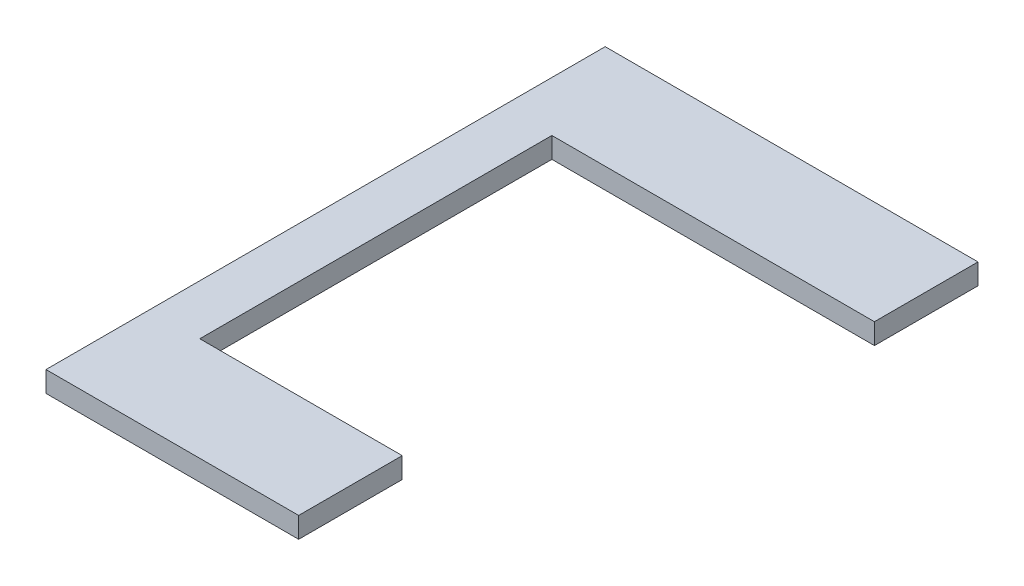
ISO-10303-21;
HEADER;
FILE_DESCRIPTION(('STEP AP214'),'2;1');
FILE_NAME('part.step','',(''),(''),'','','');
FILE_SCHEMA(('AUTOMOTIVE_DESIGN { 1 0 10303 214 1 1 1 1 }'));
ENDSEC;
DATA;
#1=APPLICATION_CONTEXT('core data for automotive mechanical design processes');
#2=APPLICATION_PROTOCOL_DEFINITION('international standard','automotive_design',2000,#1);
#3=PRODUCT_CONTEXT('',#1,'mechanical');
#4=PRODUCT('Part','Part','',(#3));
#5=PRODUCT_RELATED_PRODUCT_CATEGORY('part','',(#4));
#6=PRODUCT_DEFINITION_FORMATION('','',#4);
#7=PRODUCT_DEFINITION_CONTEXT('part definition',#1,'design');
#8=PRODUCT_DEFINITION('design','',#6,#7);
#9=PRODUCT_DEFINITION_SHAPE('','',#8);
#10=(LENGTH_UNIT() NAMED_UNIT(*) SI_UNIT(.MILLI.,.METRE.));
#11=(NAMED_UNIT(*) PLANE_ANGLE_UNIT() SI_UNIT($,.RADIAN.));
#12=(NAMED_UNIT(*) SI_UNIT($,.STERADIAN.) SOLID_ANGLE_UNIT());
#13=UNCERTAINTY_MEASURE_WITH_UNIT(LENGTH_MEASURE(1.E-05),#10,'distance_accuracy_value','');
#14=(GEOMETRIC_REPRESENTATION_CONTEXT(3) GLOBAL_UNCERTAINTY_ASSIGNED_CONTEXT((#13)) GLOBAL_UNIT_ASSIGNED_CONTEXT((#10,
#11,#12)) REPRESENTATION_CONTEXT('',''));
#15=CARTESIAN_POINT('',(0.,0.,0.));
#16=DIRECTION('',(0.,0.,1.));
#17=DIRECTION('',(1.,0.,0.));
#18=AXIS2_PLACEMENT_3D('',#15,#16,#17);
#19=CARTESIAN_POINT('',(0.,50.,0.));
#20=DIRECTION('',(0.,0.,-1.));
#21=DIRECTION('',(-1.,0.,0.));
#22=AXIS2_PLACEMENT_3D('',#19,#20,#21);
#23=PLANE('',#22);
#24=DIRECTION('',(1.,0.,0.));
#25=VECTOR('',#24,1.);
#26=CARTESIAN_POINT('',(0.,0.,0.));
#27=LINE('',#26,#25);
#28=CARTESIAN_POINT('',(0.,0.,0.));
#29=VERTEX_POINT('',#28);
#30=CARTESIAN_POINT('',(610.,0.,0.));
#31=VERTEX_POINT('',#30);
#32=EDGE_CURVE('E118',#29,#31,#27,.T.);
#33=ORIENTED_EDGE('',*,*,#32,.T.);
#34=DIRECTION('',(0.,-1.,0.));
#35=VECTOR('',#34,1.);
#36=CARTESIAN_POINT('',(610.,50.,0.));
#37=LINE('',#36,#35);
#38=CARTESIAN_POINT('',(610.,50.,0.));
#39=VERTEX_POINT('',#38);
#40=EDGE_CURVE('E154',#39,#31,#37,.T.);
#41=ORIENTED_EDGE('',*,*,#40,.F.);
#42=DIRECTION('',(1.,0.,0.));
#43=VECTOR('',#42,1.);
#44=CARTESIAN_POINT('',(0.,50.,0.));
#45=LINE('',#44,#43);
#46=CARTESIAN_POINT('',(0.,50.,0.));
#47=VERTEX_POINT('',#46);
#48=EDGE_CURVE('E131',#47,#39,#45,.T.);
#49=ORIENTED_EDGE('',*,*,#48,.F.);
#50=DIRECTION('',(0.,-1.,0.));
#51=VECTOR('',#50,1.);
#52=CARTESIAN_POINT('',(0.,50.,0.));
#53=LINE('',#52,#51);
#54=EDGE_CURVE('E114',#47,#29,#53,.T.);
#55=ORIENTED_EDGE('',*,*,#54,.T.);
#56=EDGE_LOOP('',(#33,#41,#49,#55));
#57=FACE_BOUND('',#56,.T.);
#58=ADVANCED_FACE('F30',(#57),#23,.F.);
#59=CARTESIAN_POINT('',(600.,50.,-250.));
#60=DIRECTION('',(0.,0.,1.));
#61=DIRECTION('',(1.,0.,0.));
#62=AXIS2_PLACEMENT_3D('',#59,#60,#61);
#63=PLANE('',#62);
#64=DIRECTION('',(-1.,0.,0.));
#65=VECTOR('',#64,1.);
#66=CARTESIAN_POINT('',(600.,0.,-250.));
#67=LINE('',#66,#65);
#68=CARTESIAN_POINT('',(610.,0.,-250.));
#69=VERTEX_POINT('',#68);
#70=CARTESIAN_POINT('',(121.292781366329,0.,-250.));
#71=VERTEX_POINT('',#70);
#72=EDGE_CURVE('E121',#69,#71,#67,.T.);
#73=ORIENTED_EDGE('',*,*,#72,.T.);
#74=DIRECTION('',(0.,-1.,0.));
#75=VECTOR('',#74,1.);
#76=CARTESIAN_POINT('',(121.292781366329,50.,-250.));
#77=LINE('',#76,#75);
#78=CARTESIAN_POINT('',(121.292781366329,50.,-250.));
#79=VERTEX_POINT('',#78);
#80=EDGE_CURVE('E11',#79,#71,#77,.T.);
#81=ORIENTED_EDGE('',*,*,#80,.F.);
#82=DIRECTION('',(-1.,0.,0.));
#83=VECTOR('',#82,1.);
#84=CARTESIAN_POINT('',(600.,50.,-250.));
#85=LINE('',#84,#83);
#86=CARTESIAN_POINT('',(610.,50.,-250.));
#87=VERTEX_POINT('',#86);
#88=EDGE_CURVE('E84',#87,#79,#85,.T.);
#89=ORIENTED_EDGE('',*,*,#88,.F.);
#90=DIRECTION('',(0.,1.,0.));
#91=VECTOR('',#90,1.);
#92=CARTESIAN_POINT('',(610.,0.,-250.));
#93=LINE('',#92,#91);
#94=EDGE_CURVE('E163',#69,#87,#93,.T.);
#95=ORIENTED_EDGE('',*,*,#94,.F.);
#96=EDGE_LOOP('',(#73,#81,#89,#95));
#97=FACE_BOUND('',#96,.T.);
#98=ADVANCED_FACE('F172',(#97),#63,.F.);
#99=CARTESIAN_POINT('',(121.292781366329,50.,-250.));
#100=DIRECTION('',(-1.,0.,0.));
#101=DIRECTION('',(0.,0.,1.));
#102=AXIS2_PLACEMENT_3D('',#99,#100,#101);
#103=PLANE('',#102);
#104=DIRECTION('',(0.,0.,-1.));
#105=VECTOR('',#104,1.);
#106=CARTESIAN_POINT('',(121.292781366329,0.,-250.));
#107=LINE('',#106,#105);
#108=CARTESIAN_POINT('',(121.292781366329,0.,-1100.));
#109=VERTEX_POINT('',#108);
#110=EDGE_CURVE('E124',#71,#109,#107,.T.);
#111=ORIENTED_EDGE('',*,*,#110,.T.);
#112=DIRECTION('',(0.,-1.,0.));
#113=VECTOR('',#112,1.);
#114=CARTESIAN_POINT('',(121.292781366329,50.,-1100.));
#115=LINE('',#114,#113);
#116=CARTESIAN_POINT('',(121.292781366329,50.,-1100.));
#117=VERTEX_POINT('',#116);
#118=EDGE_CURVE('E38',#117,#109,#115,.T.);
#119=ORIENTED_EDGE('',*,*,#118,.F.);
#120=DIRECTION('',(0.,0.,-1.));
#121=VECTOR('',#120,1.);
#122=CARTESIAN_POINT('',(121.292781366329,50.,-250.));
#123=LINE('',#122,#121);
#124=EDGE_CURVE('E169',#79,#117,#123,.T.);
#125=ORIENTED_EDGE('',*,*,#124,.F.);
#126=ORIENTED_EDGE('',*,*,#80,.T.);
#127=EDGE_LOOP('',(#111,#119,#125,#126));
#128=FACE_BOUND('',#127,.T.);
#129=ADVANCED_FACE('F170',(#128),#103,.F.);
#130=CARTESIAN_POINT('',(900.,50.,-1100.));
#131=DIRECTION('',(0.,0.,-1.));
#132=DIRECTION('',(-1.,0.,0.));
#133=AXIS2_PLACEMENT_3D('',#130,#131,#132);
#134=PLANE('',#133);
#135=DIRECTION('',(1.,0.,0.));
#136=VECTOR('',#135,1.);
#137=CARTESIAN_POINT('',(900.,0.,-1100.));
#138=LINE('',#137,#136);
#139=CARTESIAN_POINT('',(900.,0.,-1100.));
#140=VERTEX_POINT('',#139);
#141=EDGE_CURVE('E126',#109,#140,#138,.T.);
#142=ORIENTED_EDGE('',*,*,#141,.T.);
#143=DIRECTION('',(0.,-1.,0.));
#144=VECTOR('',#143,1.);
#145=CARTESIAN_POINT('',(900.,50.,-1100.));
#146=LINE('',#145,#144);
#147=CARTESIAN_POINT('',(900.,50.,-1100.));
#148=VERTEX_POINT('',#147);
#149=EDGE_CURVE('E109',#148,#140,#146,.T.);
#150=ORIENTED_EDGE('',*,*,#149,.F.);
#151=DIRECTION('',(1.,0.,0.));
#152=VECTOR('',#151,1.);
#153=CARTESIAN_POINT('',(900.,50.,-1100.));
#154=LINE('',#153,#152);
#155=EDGE_CURVE('E100',#117,#148,#154,.T.);
#156=ORIENTED_EDGE('',*,*,#155,.F.);
#157=ORIENTED_EDGE('',*,*,#118,.T.);
#158=EDGE_LOOP('',(#142,#150,#156,#157));
#159=FACE_BOUND('',#158,.T.);
#160=ADVANCED_FACE('F138',(#159),#134,.F.);
#161=CARTESIAN_POINT('',(900.,50.,-1350.));
#162=DIRECTION('',(-1.,0.,0.));
#163=DIRECTION('',(0.,0.,1.));
#164=AXIS2_PLACEMENT_3D('',#161,#162,#163);
#165=PLANE('',#164);
#166=DIRECTION('',(0.,0.,-1.));
#167=VECTOR('',#166,1.);
#168=CARTESIAN_POINT('',(900.,0.,-1350.));
#169=LINE('',#168,#167);
#170=CARTESIAN_POINT('',(900.,0.,-1350.));
#171=VERTEX_POINT('',#170);
#172=EDGE_CURVE('E108',#140,#171,#169,.T.);
#173=ORIENTED_EDGE('',*,*,#172,.T.);
#174=DIRECTION('',(0.,-1.,0.));
#175=VECTOR('',#174,1.);
#176=CARTESIAN_POINT('',(900.,50.,-1350.));
#177=LINE('',#176,#175);
#178=CARTESIAN_POINT('',(900.,50.,-1350.));
#179=VERTEX_POINT('',#178);
#180=EDGE_CURVE('E105',#179,#171,#177,.T.);
#181=ORIENTED_EDGE('',*,*,#180,.F.);
#182=DIRECTION('',(0.,0.,-1.));
#183=VECTOR('',#182,1.);
#184=CARTESIAN_POINT('',(900.,50.,-1350.));
#185=LINE('',#184,#183);
#186=EDGE_CURVE('E94',#148,#179,#185,.T.);
#187=ORIENTED_EDGE('',*,*,#186,.F.);
#188=ORIENTED_EDGE('',*,*,#149,.T.);
#189=EDGE_LOOP('',(#173,#181,#187,#188));
#190=FACE_BOUND('',#189,.T.);
#191=ADVANCED_FACE('F106',(#190),#165,.F.);
#192=CARTESIAN_POINT('',(0.,50.,-1350.));
#193=DIRECTION('',(0.,0.,1.));
#194=DIRECTION('',(1.,0.,0.));
#195=AXIS2_PLACEMENT_3D('',#192,#193,#194);
#196=PLANE('',#195);
#197=DIRECTION('',(-1.,0.,0.));
#198=VECTOR('',#197,1.);
#199=CARTESIAN_POINT('',(0.,0.,-1350.));
#200=LINE('',#199,#198);
#201=CARTESIAN_POINT('',(0.,0.,-1350.));
#202=VERTEX_POINT('',#201);
#203=EDGE_CURVE('E70',#171,#202,#200,.T.);
#204=ORIENTED_EDGE('',*,*,#203,.T.);
#205=DIRECTION('',(0.,-1.,0.));
#206=VECTOR('',#205,1.);
#207=CARTESIAN_POINT('',(0.,50.,-1350.));
#208=LINE('',#207,#206);
#209=CARTESIAN_POINT('',(0.,50.,-1350.));
#210=VERTEX_POINT('',#209);
#211=EDGE_CURVE('E110',#210,#202,#208,.T.);
#212=ORIENTED_EDGE('',*,*,#211,.F.);
#213=DIRECTION('',(-1.,0.,0.));
#214=VECTOR('',#213,1.);
#215=CARTESIAN_POINT('',(0.,50.,-1350.));
#216=LINE('',#215,#214);
#217=EDGE_CURVE('E98',#179,#210,#216,.T.);
#218=ORIENTED_EDGE('',*,*,#217,.F.);
#219=ORIENTED_EDGE('',*,*,#180,.T.);
#220=EDGE_LOOP('',(#204,#212,#218,#219));
#221=FACE_BOUND('',#220,.T.);
#222=ADVANCED_FACE('F112',(#221),#196,.F.);
#223=CARTESIAN_POINT('',(0.,50.,0.));
#224=DIRECTION('',(1.,0.,0.));
#225=DIRECTION('',(0.,0.,-1.));
#226=AXIS2_PLACEMENT_3D('',#223,#224,#225);
#227=PLANE('',#226);
#228=DIRECTION('',(0.,0.,1.));
#229=VECTOR('',#228,1.);
#230=CARTESIAN_POINT('',(0.,0.,0.));
#231=LINE('',#230,#229);
#232=EDGE_CURVE('E76',#202,#29,#231,.T.);
#233=ORIENTED_EDGE('',*,*,#232,.T.);
#234=ORIENTED_EDGE('',*,*,#54,.F.);
#235=DIRECTION('',(0.,0.,1.));
#236=VECTOR('',#235,1.);
#237=CARTESIAN_POINT('',(0.,50.,0.));
#238=LINE('',#237,#236);
#239=EDGE_CURVE('E46',#210,#47,#238,.T.);
#240=ORIENTED_EDGE('',*,*,#239,.F.);
#241=ORIENTED_EDGE('',*,*,#211,.T.);
#242=EDGE_LOOP('',(#233,#234,#240,#241));
#243=FACE_BOUND('',#242,.T.);
#244=ADVANCED_FACE('F189',(#243),#227,.F.);
#245=CARTESIAN_POINT('',(600.,50.,0.));
#246=DIRECTION('',(0.,1.,0.));
#247=DIRECTION('',(0.,0.,1.));
#248=AXIS2_PLACEMENT_3D('',#245,#246,#247);
#249=PLANE('',#248);
#250=ORIENTED_EDGE('',*,*,#48,.T.);
#251=DIRECTION('',(0.,0.,1.));
#252=VECTOR('',#251,1.);
#253=CARTESIAN_POINT('',(610.,50.,-250.));
#254=LINE('',#253,#252);
#255=EDGE_CURVE('E160',#87,#39,#254,.T.);
#256=ORIENTED_EDGE('',*,*,#255,.F.);
#257=ORIENTED_EDGE('',*,*,#88,.T.);
#258=ORIENTED_EDGE('',*,*,#124,.T.);
#259=ORIENTED_EDGE('',*,*,#155,.T.);
#260=ORIENTED_EDGE('',*,*,#186,.T.);
#261=ORIENTED_EDGE('',*,*,#217,.T.);
#262=ORIENTED_EDGE('',*,*,#239,.T.);
#263=EDGE_LOOP('',(#250,#256,#257,#258,#259,#260,#261,#262));
#264=FACE_BOUND('',#263,.T.);
#265=ADVANCED_FACE('F96',(#264),#249,.T.);
#266=CARTESIAN_POINT('',(600.,0.,0.));
#267=DIRECTION('',(0.,1.,0.));
#268=DIRECTION('',(0.,0.,1.));
#269=AXIS2_PLACEMENT_3D('',#266,#267,#268);
#270=PLANE('',#269);
#271=ORIENTED_EDGE('',*,*,#32,.F.);
#272=ORIENTED_EDGE('',*,*,#232,.F.);
#273=ORIENTED_EDGE('',*,*,#203,.F.);
#274=ORIENTED_EDGE('',*,*,#172,.F.);
#275=ORIENTED_EDGE('',*,*,#141,.F.);
#276=ORIENTED_EDGE('',*,*,#110,.F.);
#277=ORIENTED_EDGE('',*,*,#72,.F.);
#278=DIRECTION('',(0.,0.,-1.));
#279=VECTOR('',#278,1.);
#280=CARTESIAN_POINT('',(610.,0.,0.));
#281=LINE('',#280,#279);
#282=EDGE_CURVE('E122',#31,#69,#281,.T.);
#283=ORIENTED_EDGE('',*,*,#282,.F.);
#284=EDGE_LOOP('',(#271,#272,#273,#274,#275,#276,#277,#283));
#285=FACE_BOUND('',#284,.T.);
#286=ADVANCED_FACE('F144',(#285),#270,.F.);
#287=CARTESIAN_POINT('',(610.,50.,-250.));
#288=DIRECTION('',(1.,0.,0.));
#289=DIRECTION('',(0.,0.,-1.));
#290=AXIS2_PLACEMENT_3D('',#287,#288,#289);
#291=PLANE('',#290);
#292=ORIENTED_EDGE('',*,*,#94,.T.);
#293=ORIENTED_EDGE('',*,*,#255,.T.);
#294=ORIENTED_EDGE('',*,*,#40,.T.);
#295=ORIENTED_EDGE('',*,*,#282,.T.);
#296=EDGE_LOOP('',(#292,#293,#294,#295));
#297=FACE_BOUND('',#296,.T.);
#298=ADVANCED_FACE('F158',(#297),#291,.T.);
#299=CLOSED_SHELL('',(#58,#98,#129,#160,#191,#222,#244,#265,#286,#298));
#300=MANIFOLD_SOLID_BREP('B2',#299);
#301=ADVANCED_BREP_SHAPE_REPRESENTATION('',(#18,#300),#14);
#302=SHAPE_DEFINITION_REPRESENTATION(#9,#301);
ENDSEC;
END-ISO-10303-21;
